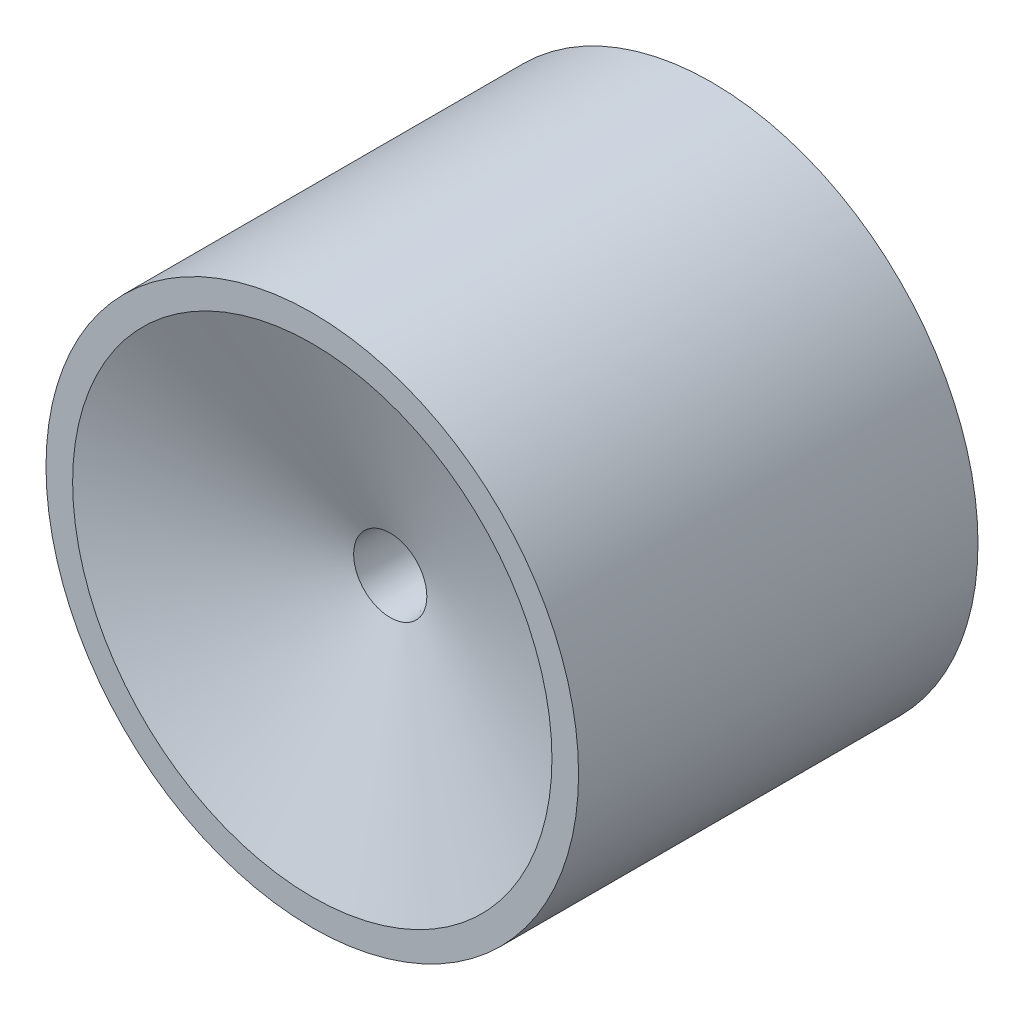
ISO-10303-21;
HEADER;
FILE_DESCRIPTION(('STEP AP214'),'2;1');
FILE_NAME('part.step','',(''),(''),'','','');
FILE_SCHEMA(('AUTOMOTIVE_DESIGN { 1 0 10303 214 1 1 1 1 }'));
ENDSEC;
DATA;
#1=APPLICATION_CONTEXT('core data for automotive mechanical design processes');
#2=APPLICATION_PROTOCOL_DEFINITION('international standard','automotive_design',2000,#1);
#3=PRODUCT_CONTEXT('',#1,'mechanical');
#4=PRODUCT('Part','Part','',(#3));
#5=PRODUCT_RELATED_PRODUCT_CATEGORY('part','',(#4));
#6=PRODUCT_DEFINITION_FORMATION('','',#4);
#7=PRODUCT_DEFINITION_CONTEXT('part definition',#1,'design');
#8=PRODUCT_DEFINITION('design','',#6,#7);
#9=PRODUCT_DEFINITION_SHAPE('','',#8);
#10=(LENGTH_UNIT() NAMED_UNIT(*) SI_UNIT(.MILLI.,.METRE.));
#11=(NAMED_UNIT(*) PLANE_ANGLE_UNIT() SI_UNIT($,.RADIAN.));
#12=(NAMED_UNIT(*) SI_UNIT($,.STERADIAN.) SOLID_ANGLE_UNIT());
#13=UNCERTAINTY_MEASURE_WITH_UNIT(LENGTH_MEASURE(1.E-05),#10,'distance_accuracy_value','');
#14=(GEOMETRIC_REPRESENTATION_CONTEXT(3) GLOBAL_UNCERTAINTY_ASSIGNED_CONTEXT((#13)) GLOBAL_UNIT_ASSIGNED_CONTEXT((#10,
#11,#12)) REPRESENTATION_CONTEXT('',''));
#15=CARTESIAN_POINT('',(0.,0.,0.));
#16=DIRECTION('',(0.,0.,1.));
#17=DIRECTION('',(1.,0.,0.));
#18=AXIS2_PLACEMENT_3D('',#15,#16,#17);
#19=CARTESIAN_POINT('',(0.,0.,0.));
#20=DIRECTION('',(0.,0.,1.));
#21=DIRECTION('',(1.,0.,0.));
#22=AXIS2_PLACEMENT_3D('',#19,#20,#21);
#23=PLANE('',#22);
#24=CARTESIAN_POINT('',(0.,0.,0.));
#25=DIRECTION('',(0.,0.,1.));
#26=DIRECTION('',(1.,0.,0.));
#27=AXIS2_PLACEMENT_3D('',#24,#25,#26);
#28=CIRCLE('',#27,3.4);
#29=CARTESIAN_POINT('',(3.4,0.,0.));
#30=VERTEX_POINT('',#29);
#31=EDGE_CURVE('E46',#30,#30,#28,.T.);
#32=ORIENTED_EDGE('',*,*,#31,.T.);
#33=EDGE_LOOP('',(#32));
#34=FACE_BOUND('',#33,.T.);
#35=CARTESIAN_POINT('',(0.,0.,0.));
#36=DIRECTION('',(0.,0.,-1.));
#37=DIRECTION('',(-1.,0.,0.));
#38=AXIS2_PLACEMENT_3D('',#35,#36,#37);
#39=CIRCLE('',#38,5.5);
#40=CARTESIAN_POINT('',(-5.5,0.,0.));
#41=VERTEX_POINT('',#40);
#42=EDGE_CURVE('E64',#41,#41,#39,.T.);
#43=ORIENTED_EDGE('',*,*,#42,.T.);
#44=EDGE_LOOP('',(#43));
#45=FACE_BOUND('',#44,.T.);
#46=ADVANCED_FACE('F31',(#34,#45),#23,.F.);
#47=CARTESIAN_POINT('',(0.,0.,0.));
#48=DIRECTION('',(0.,0.,-1.));
#49=DIRECTION('',(-1.,0.,0.));
#50=AXIS2_PLACEMENT_3D('',#47,#48,#49);
#51=CIRCLE('',#50,9.);
#52=CARTESIAN_POINT('',(-9.,0.,0.));
#53=VERTEX_POINT('',#52);
#54=EDGE_CURVE('E58',#53,#53,#51,.T.);
#55=ORIENTED_EDGE('',*,*,#54,.F.);
#56=EDGE_LOOP('',(#55));
#57=FACE_BOUND('',#56,.T.);
#58=CARTESIAN_POINT('',(0.,0.,0.));
#59=DIRECTION('',(0.,0.,1.));
#60=DIRECTION('',(1.,0.,0.));
#61=AXIS2_PLACEMENT_3D('',#58,#59,#60);
#62=CIRCLE('',#61,10.);
#63=CARTESIAN_POINT('',(10.,0.,0.));
#64=VERTEX_POINT('',#63);
#65=EDGE_CURVE('E39',#64,#64,#62,.T.);
#66=ORIENTED_EDGE('',*,*,#65,.F.);
#67=EDGE_LOOP('',(#66));
#68=FACE_BOUND('',#67,.T.);
#69=ADVANCED_FACE('F86',(#57,#68),#23,.F.);
#70=CARTESIAN_POINT('',(0.,0.,15.));
#71=DIRECTION('',(0.,0.,-1.));
#72=DIRECTION('',(-1.,0.,0.));
#73=AXIS2_PLACEMENT_3D('',#70,#71,#72);
#74=CYLINDRICAL_SURFACE('',#73,10.);
#75=CARTESIAN_POINT('',(0.,0.,15.));
#76=DIRECTION('',(0.,0.,1.));
#77=DIRECTION('',(1.,0.,0.));
#78=AXIS2_PLACEMENT_3D('',#75,#76,#77);
#79=CIRCLE('',#78,10.);
#80=CARTESIAN_POINT('',(10.,0.,15.));
#81=VERTEX_POINT('',#80);
#82=EDGE_CURVE('E10',#81,#81,#79,.T.);
#83=ORIENTED_EDGE('',*,*,#82,.F.);
#84=EDGE_LOOP('',(#83));
#85=FACE_BOUND('',#84,.T.);
#86=ORIENTED_EDGE('',*,*,#65,.T.);
#87=EDGE_LOOP('',(#86));
#88=FACE_BOUND('',#87,.T.);
#89=ADVANCED_FACE('F33',(#85,#88),#74,.T.);
#90=CARTESIAN_POINT('',(0.,0.,15.));
#91=DIRECTION('',(0.,0.,1.));
#92=DIRECTION('',(1.,0.,0.));
#93=AXIS2_PLACEMENT_3D('',#90,#91,#92);
#94=PLANE('',#93);
#95=CARTESIAN_POINT('',(0.,0.,15.));
#96=DIRECTION('',(0.,0.,1.));
#97=DIRECTION('',(1.,0.,0.));
#98=AXIS2_PLACEMENT_3D('',#95,#96,#97);
#99=CIRCLE('',#98,9.);
#100=CARTESIAN_POINT('',(9.,0.,15.));
#101=VERTEX_POINT('',#100);
#102=EDGE_CURVE('E54',#101,#101,#99,.T.);
#103=ORIENTED_EDGE('',*,*,#102,.F.);
#104=EDGE_LOOP('',(#103));
#105=FACE_BOUND('',#104,.T.);
#106=ORIENTED_EDGE('',*,*,#82,.T.);
#107=EDGE_LOOP('',(#106));
#108=FACE_BOUND('',#107,.T.);
#109=ADVANCED_FACE('F92',(#105,#108),#94,.T.);
#110=CARTESIAN_POINT('',(0.,0.,8.));
#111=DIRECTION('',(0.,0.,-1.));
#112=DIRECTION('',(-1.,0.,0.));
#113=AXIS2_PLACEMENT_3D('',#110,#111,#112);
#114=CYLINDRICAL_SURFACE('',#113,3.4);
#115=CARTESIAN_POINT('',(0.,0.,8.));
#116=DIRECTION('',(0.,0.,1.));
#117=DIRECTION('',(1.,0.,0.));
#118=AXIS2_PLACEMENT_3D('',#115,#116,#117);
#119=CIRCLE('',#118,3.4);
#120=CARTESIAN_POINT('',(3.4,0.,8.));
#121=VERTEX_POINT('',#120);
#122=EDGE_CURVE('E44',#121,#121,#119,.T.);
#123=ORIENTED_EDGE('',*,*,#122,.T.);
#124=EDGE_LOOP('',(#123));
#125=FACE_BOUND('',#124,.T.);
#126=ORIENTED_EDGE('',*,*,#31,.F.);
#127=EDGE_LOOP('',(#126));
#128=FACE_BOUND('',#127,.T.);
#129=ADVANCED_FACE('F97',(#125,#128),#114,.F.);
#130=CARTESIAN_POINT('',(0.,0.,8.));
#131=DIRECTION('',(0.,0.,1.));
#132=DIRECTION('',(1.,0.,0.));
#133=AXIS2_PLACEMENT_3D('',#130,#131,#132);
#134=PLANE('',#133);
#135=CARTESIAN_POINT('',(0.,0.,8.));
#136=DIRECTION('',(0.,0.,-1.));
#137=DIRECTION('',(-1.,0.,0.));
#138=AXIS2_PLACEMENT_3D('',#135,#136,#137);
#139=CIRCLE('',#138,1.2);
#140=CARTESIAN_POINT('',(-1.2,0.,8.));
#141=VERTEX_POINT('',#140);
#142=EDGE_CURVE('E49',#141,#141,#139,.T.);
#143=ORIENTED_EDGE('',*,*,#142,.F.);
#144=EDGE_LOOP('',(#143));
#145=FACE_BOUND('',#144,.T.);
#146=ORIENTED_EDGE('',*,*,#122,.F.);
#147=EDGE_LOOP('',(#146));
#148=FACE_BOUND('',#147,.T.);
#149=ADVANCED_FACE('F108',(#145,#148),#134,.F.);
#150=CARTESIAN_POINT('',(0.,0.,8.));
#151=DIRECTION('',(0.,0.,1.));
#152=DIRECTION('',(-1.,0.,0.));
#153=AXIS2_PLACEMENT_3D('',#150,#151,#152);
#154=CONICAL_SURFACE('',#153,1.2,0.0427605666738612);
#155=CARTESIAN_POINT('',(0.,0.,12.0727524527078));
#156=DIRECTION('',(0.,0.,1.));
#157=DIRECTION('',(1.,0.,0.));
#158=AXIS2_PLACEMENT_3D('',#155,#156,#157);
#159=CIRCLE('',#158,1.3742594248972);
#160=CARTESIAN_POINT('',(1.3742594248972,0.,12.0727524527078));
#161=VERTEX_POINT('',#160);
#162=EDGE_CURVE('E35',#161,#161,#159,.T.);
#163=ORIENTED_EDGE('',*,*,#162,.T.);
#164=EDGE_LOOP('',(#163));
#165=FACE_BOUND('',#164,.T.);
#166=ORIENTED_EDGE('',*,*,#142,.T.);
#167=EDGE_LOOP('',(#166));
#168=FACE_BOUND('',#167,.T.);
#169=ADVANCED_FACE('F112',(#165,#168),#154,.F.);
#170=CARTESIAN_POINT('',(0.,0.,15.));
#171=DIRECTION('',(0.,0.,1.));
#172=DIRECTION('',(1.,0.,0.));
#173=AXIS2_PLACEMENT_3D('',#170,#171,#172);
#174=CONICAL_SURFACE('',#173,9.,1.20427718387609);
#175=CARTESIAN_POINT('',(9.,0.,15.));
#176=CARTESIAN_POINT('',(8.92056520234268,0.,14.969507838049));
#177=CARTESIAN_POINT('',(8.84113040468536,0.,14.9390156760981));
#178=CARTESIAN_POINT('',(8.68226080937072,0.,14.8780313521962));
#179=CARTESIAN_POINT('',(8.60282601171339,0.,14.8475391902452));
#180=CARTESIAN_POINT('',(8.44395641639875,0.,14.7865548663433));
#181=CARTESIAN_POINT('',(8.36452161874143,0.,14.7560627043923));
#182=CARTESIAN_POINT('',(8.20565202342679,0.,14.6950783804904));
#183=CARTESIAN_POINT('',(8.12621722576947,0.,14.6645862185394));
#184=CARTESIAN_POINT('',(7.96734763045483,0.,14.6036018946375));
#185=CARTESIAN_POINT('',(7.8879128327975,0.,14.5731097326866));
#186=CARTESIAN_POINT('',(7.72904323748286,0.,14.5121254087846));
#187=CARTESIAN_POINT('',(7.64960843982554,0.,14.4816332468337));
#188=CARTESIAN_POINT('',(7.4907388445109,0.,14.4206489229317));
#189=CARTESIAN_POINT('',(7.41130404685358,0.,14.3901567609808));
#190=CARTESIAN_POINT('',(7.25243445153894,0.,14.3291724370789));
#191=CARTESIAN_POINT('',(7.17299965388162,0.,14.2986802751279));
#192=CARTESIAN_POINT('',(7.01413005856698,0.,14.237695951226));
#193=CARTESIAN_POINT('',(6.93469526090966,0.,14.207203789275));
#194=CARTESIAN_POINT('',(6.77582566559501,0.,14.1462194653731));
#195=CARTESIAN_POINT('',(6.6963908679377,0.,14.1157273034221));
#196=CARTESIAN_POINT('',(6.53752127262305,0.,14.0547429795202));
#197=CARTESIAN_POINT('',(6.45808647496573,0.,14.0242508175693));
#198=CARTESIAN_POINT('',(6.29921687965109,0.,13.9632664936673));
#199=CARTESIAN_POINT('',(6.21978208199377,0.,13.9327743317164));
#200=CARTESIAN_POINT('',(6.06091248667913,0.,13.8717900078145));
#201=CARTESIAN_POINT('',(5.98147768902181,0.,13.8412978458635));
#202=CARTESIAN_POINT('',(5.82260809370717,0.,13.7803135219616));
#203=CARTESIAN_POINT('',(5.74317329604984,0.,13.7498213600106));
#204=CARTESIAN_POINT('',(5.5843037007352,0.,13.6888370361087));
#205=CARTESIAN_POINT('',(5.50486890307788,0.,13.6583448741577));
#206=CARTESIAN_POINT('',(5.34599930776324,0.,13.5973605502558));
#207=CARTESIAN_POINT('',(5.26656451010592,0.,13.5668683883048));
#208=CARTESIAN_POINT('',(5.10769491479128,0.,13.5058840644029));
#209=CARTESIAN_POINT('',(5.02826011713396,0.,13.475391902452));
#210=CARTESIAN_POINT('',(4.86939052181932,0.,13.41440757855));
#211=CARTESIAN_POINT('',(4.789955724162,0.,13.3839154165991));
#212=CARTESIAN_POINT('',(4.63108612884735,0.,13.3229310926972));
#213=CARTESIAN_POINT('',(4.55165133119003,0.,13.2924389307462));
#214=CARTESIAN_POINT('',(4.39278173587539,0.,13.2314546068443));
#215=CARTESIAN_POINT('',(4.31334693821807,0.,13.2009624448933));
#216=CARTESIAN_POINT('',(4.15447734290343,0.,13.1399781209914));
#217=CARTESIAN_POINT('',(4.07504254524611,0.,13.1094859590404));
#218=CARTESIAN_POINT('',(3.91617294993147,0.,13.0485016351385));
#219=CARTESIAN_POINT('',(3.83673815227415,0.,13.0180094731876));
#220=CARTESIAN_POINT('',(3.6778685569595,0.,12.9570251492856));
#221=CARTESIAN_POINT('',(3.59843375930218,0.,12.9265329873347));
#222=CARTESIAN_POINT('',(3.43956416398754,0.,12.8655486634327));
#223=CARTESIAN_POINT('',(3.36012936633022,0.,12.8350565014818));
#224=CARTESIAN_POINT('',(3.20125977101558,0.,12.7740721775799));
#225=CARTESIAN_POINT('',(3.12182497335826,0.,12.7435800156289));
#226=CARTESIAN_POINT('',(2.96295537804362,0.,12.682595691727));
#227=CARTESIAN_POINT('',(2.8835205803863,0.,12.652103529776));
#228=CARTESIAN_POINT('',(2.72465098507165,0.,12.5911192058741));
#229=CARTESIAN_POINT('',(2.64521618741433,0.,12.5606270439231));
#230=CARTESIAN_POINT('',(2.48634659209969,0.,12.4996427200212));
#231=CARTESIAN_POINT('',(2.40691179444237,0.,12.4691505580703));
#232=CARTESIAN_POINT('',(2.24804219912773,0.,12.4081662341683));
#233=CARTESIAN_POINT('',(2.16860740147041,0.,12.3776740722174));
#234=CARTESIAN_POINT('',(2.00973780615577,0.,12.3166897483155));
#235=CARTESIAN_POINT('',(1.93030300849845,0.,12.2861975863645));
#236=CARTESIAN_POINT('',(1.7714334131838,0.,12.2252132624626));
#237=CARTESIAN_POINT('',(1.69199861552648,0.,12.1947211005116));
#238=CARTESIAN_POINT('',(1.53312902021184,0.,12.1337367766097));
#239=CARTESIAN_POINT('',(1.45369422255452,0.,12.1032446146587));
#240=CARTESIAN_POINT('',(1.3742594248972,0.,12.0727524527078));
#241=B_SPLINE_CURVE_WITH_KNOTS('',3,(#175,#176,#177,#178,#179,#180,#181,#182,#183,#184,#185,
#186,#187,#188,#189,#190,#191,#192,#193,#194,#195,#196,#197,#198,#199,#200,#201,#202,#203,#204,
#205,#206,#207,#208,#209,#210,#211,#212,#213,#214,#215,#216,#217,#218,#219,#220,#221,#222,#223,
#224,#225,#226,#227,#228,#229,#230,#231,#232,#233,#234,#235,#236,#237,#238,#239,#240),
.UNSPECIFIED.,.F.,.F.,(4,2,2,2,2,2,2,2,2,2,2,2,2,2,2,2,2,2,2,2,2,2,2,2,2,2,2,2,2,2,2,2,4),(0.,
0.255258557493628,0.510517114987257,0.765775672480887,1.02103422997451,1.27629278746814,
1.53155134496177,1.7868099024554,2.04206845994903,2.29732701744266,2.55258557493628,
2.80784413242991,3.06310268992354,3.31836124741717,3.5736198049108,3.82887836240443,
4.08413691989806,4.33939547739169,4.59465403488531,4.84991259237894,5.10517114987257,
5.3604297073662,5.61568826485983,5.87094682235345,6.12620537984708,6.38146393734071,
6.63672249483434,6.89198105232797,7.1472396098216,7.40249816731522,7.65775672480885,
7.91301528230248,8.16827383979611),.UNSPECIFIED.);
#242=EDGE_CURVE('BSEAM82',#101,#161,#241,.T.);
#243=ORIENTED_EDGE('',*,*,#102,.T.);
#244=ORIENTED_EDGE('',*,*,#162,.F.);
#245=ORIENTED_EDGE('',*,*,#242,.T.);
#246=ORIENTED_EDGE('',*,*,#242,.F.);
#247=EDGE_LOOP('',(#243,#245,#244,#246));
#248=FACE_BOUND('',#247,.T.);
#249=ADVANCED_FACE('F82',(#248),#174,.F.);
#250=CARTESIAN_POINT('',(0.,0.,13.));
#251=DIRECTION('',(0.,0.,-1.));
#252=DIRECTION('',(-1.,0.,0.));
#253=AXIS2_PLACEMENT_3D('',#250,#251,#252);
#254=CYLINDRICAL_SURFACE('',#253,9.);
#255=CARTESIAN_POINT('',(0.,0.,13.));
#256=DIRECTION('',(0.,0.,-1.));
#257=DIRECTION('',(-1.,0.,0.));
#258=AXIS2_PLACEMENT_3D('',#255,#256,#257);
#259=CIRCLE('',#258,9.);
#260=CARTESIAN_POINT('',(-9.,0.,13.));
#261=VERTEX_POINT('',#260);
#262=EDGE_CURVE('E57',#261,#261,#259,.T.);
#263=CARTESIAN_POINT('',(-9.,0.,13.));
#264=CARTESIAN_POINT('',(-9.,0.,12.8645833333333));
#265=CARTESIAN_POINT('',(-9.,0.,12.7291666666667));
#266=CARTESIAN_POINT('',(-9.,0.,12.4583333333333));
#267=CARTESIAN_POINT('',(-9.,0.,12.3229166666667));
#268=CARTESIAN_POINT('',(-9.,0.,12.0520833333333));
#269=CARTESIAN_POINT('',(-9.,0.,11.9166666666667));
#270=CARTESIAN_POINT('',(-9.,0.,11.6458333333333));
#271=CARTESIAN_POINT('',(-9.,0.,11.5104166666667));
#272=CARTESIAN_POINT('',(-9.,0.,11.2395833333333));
#273=CARTESIAN_POINT('',(-9.,0.,11.1041666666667));
#274=CARTESIAN_POINT('',(-9.,0.,10.8333333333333));
#275=CARTESIAN_POINT('',(-9.,0.,10.6979166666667));
#276=CARTESIAN_POINT('',(-9.,0.,10.4270833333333));
#277=CARTESIAN_POINT('',(-9.,0.,10.2916666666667));
#278=CARTESIAN_POINT('',(-9.,0.,10.0208333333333));
#279=CARTESIAN_POINT('',(-9.,0.,9.88541666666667));
#280=CARTESIAN_POINT('',(-9.,0.,9.61458333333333));
#281=CARTESIAN_POINT('',(-9.,0.,9.47916666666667));
#282=CARTESIAN_POINT('',(-9.,0.,9.20833333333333));
#283=CARTESIAN_POINT('',(-9.,0.,9.07291666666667));
#284=CARTESIAN_POINT('',(-9.,0.,8.80208333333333));
#285=CARTESIAN_POINT('',(-9.,0.,8.66666666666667));
#286=CARTESIAN_POINT('',(-9.,0.,8.39583333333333));
#287=CARTESIAN_POINT('',(-9.,0.,8.26041666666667));
#288=CARTESIAN_POINT('',(-9.,0.,7.98958333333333));
#289=CARTESIAN_POINT('',(-9.,0.,7.85416666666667));
#290=CARTESIAN_POINT('',(-9.,0.,7.58333333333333));
#291=CARTESIAN_POINT('',(-9.,0.,7.44791666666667));
#292=CARTESIAN_POINT('',(-9.,0.,7.17708333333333));
#293=CARTESIAN_POINT('',(-9.,0.,7.04166666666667));
#294=CARTESIAN_POINT('',(-9.,0.,6.77083333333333));
#295=CARTESIAN_POINT('',(-9.,0.,6.63541666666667));
#296=CARTESIAN_POINT('',(-9.,0.,6.36458333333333));
#297=CARTESIAN_POINT('',(-9.,0.,6.22916666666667));
#298=CARTESIAN_POINT('',(-9.,0.,5.95833333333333));
#299=CARTESIAN_POINT('',(-9.,0.,5.82291666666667));
#300=CARTESIAN_POINT('',(-9.,0.,5.55208333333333));
#301=CARTESIAN_POINT('',(-9.,0.,5.41666666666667));
#302=CARTESIAN_POINT('',(-9.,0.,5.14583333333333));
#303=CARTESIAN_POINT('',(-9.,0.,5.01041666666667));
#304=CARTESIAN_POINT('',(-9.,0.,4.73958333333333));
#305=CARTESIAN_POINT('',(-9.,0.,4.60416666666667));
#306=CARTESIAN_POINT('',(-9.,0.,4.33333333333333));
#307=CARTESIAN_POINT('',(-9.,0.,4.19791666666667));
#308=CARTESIAN_POINT('',(-9.,0.,3.92708333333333));
#309=CARTESIAN_POINT('',(-9.,0.,3.79166666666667));
#310=CARTESIAN_POINT('',(-9.,0.,3.52083333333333));
#311=CARTESIAN_POINT('',(-9.,0.,3.38541666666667));
#312=CARTESIAN_POINT('',(-9.,0.,3.11458333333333));
#313=CARTESIAN_POINT('',(-9.,0.,2.97916666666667));
#314=CARTESIAN_POINT('',(-9.,0.,2.70833333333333));
#315=CARTESIAN_POINT('',(-9.,0.,2.57291666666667));
#316=CARTESIAN_POINT('',(-9.,0.,2.30208333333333));
#317=CARTESIAN_POINT('',(-9.,0.,2.16666666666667));
#318=CARTESIAN_POINT('',(-9.,0.,1.89583333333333));
#319=CARTESIAN_POINT('',(-9.,0.,1.76041666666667));
#320=CARTESIAN_POINT('',(-9.,0.,1.48958333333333));
#321=CARTESIAN_POINT('',(-9.,0.,1.35416666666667));
#322=CARTESIAN_POINT('',(-9.,0.,1.08333333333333));
#323=CARTESIAN_POINT('',(-9.,0.,0.947916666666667));
#324=CARTESIAN_POINT('',(-9.,0.,0.677083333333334));
#325=CARTESIAN_POINT('',(-9.,0.,0.541666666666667));
#326=CARTESIAN_POINT('',(-9.,0.,0.270833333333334));
#327=CARTESIAN_POINT('',(-9.,0.,0.135416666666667));
#328=CARTESIAN_POINT('',(-9.,0.,0.));
#329=B_SPLINE_CURVE_WITH_KNOTS('',3,(#263,#264,#265,#266,#267,#268,#269,#270,#271,#272,#273,
#274,#275,#276,#277,#278,#279,#280,#281,#282,#283,#284,#285,#286,#287,#288,#289,#290,#291,#292,
#293,#294,#295,#296,#297,#298,#299,#300,#301,#302,#303,#304,#305,#306,#307,#308,#309,#310,#311,
#312,#313,#314,#315,#316,#317,#318,#319,#320,#321,#322,#323,#324,#325,#326,#327,#328),
.UNSPECIFIED.,.F.,.F.,(4,2,2,2,2,2,2,2,2,2,2,2,2,2,2,2,2,2,2,2,2,2,2,2,2,2,2,2,2,2,2,2,4),(0.,
0.406249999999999,0.812499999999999,1.21875,1.625,2.03125,2.4375,2.84375,3.25,3.65625,4.0625,
4.46875,4.875,5.28125,5.6875,6.09375,6.5,6.90625,7.3125,7.71875,8.125,8.53125,8.9375,9.34375,
9.75,10.15625,10.5625,10.96875,11.375,11.78125,12.1875,12.59375,13.),.UNSPECIFIED.);
#330=EDGE_CURVE('BSEAM76',#261,#53,#329,.T.);
#331=ORIENTED_EDGE('',*,*,#262,.F.);
#332=ORIENTED_EDGE('',*,*,#54,.T.);
#333=ORIENTED_EDGE('',*,*,#330,.T.);
#334=ORIENTED_EDGE('',*,*,#330,.F.);
#335=EDGE_LOOP('',(#331,#333,#332,#334));
#336=FACE_BOUND('',#335,.T.);
#337=ADVANCED_FACE('F76',(#336),#254,.F.);
#338=CARTESIAN_POINT('',(0.,0.,13.));
#339=DIRECTION('',(0.,0.,-1.));
#340=DIRECTION('',(-1.,0.,0.));
#341=AXIS2_PLACEMENT_3D('',#338,#339,#340);
#342=PLANE('',#341);
#343=CARTESIAN_POINT('',(0.,0.,13.));
#344=DIRECTION('',(0.,0.,-1.));
#345=DIRECTION('',(-1.,0.,0.));
#346=AXIS2_PLACEMENT_3D('',#343,#344,#345);
#347=CIRCLE('',#346,5.5);
#348=CARTESIAN_POINT('',(-5.5,0.,13.));
#349=VERTEX_POINT('',#348);
#350=EDGE_CURVE('E61',#349,#349,#347,.T.);
#351=ORIENTED_EDGE('',*,*,#350,.F.);
#352=EDGE_LOOP('',(#351));
#353=FACE_BOUND('',#352,.T.);
#354=ORIENTED_EDGE('',*,*,#262,.T.);
#355=EDGE_LOOP('',(#354));
#356=FACE_BOUND('',#355,.T.);
#357=ADVANCED_FACE('F73',(#353,#356),#342,.T.);
#358=CARTESIAN_POINT('',(0.,0.,13.));
#359=DIRECTION('',(0.,0.,-1.));
#360=DIRECTION('',(-1.,0.,0.));
#361=AXIS2_PLACEMENT_3D('',#358,#359,#360);
#362=CYLINDRICAL_SURFACE('',#361,5.5);
#363=CARTESIAN_POINT('',(-5.5,0.,13.));
#364=CARTESIAN_POINT('',(-5.5,0.,12.8645833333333));
#365=CARTESIAN_POINT('',(-5.5,0.,12.7291666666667));
#366=CARTESIAN_POINT('',(-5.5,0.,12.4583333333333));
#367=CARTESIAN_POINT('',(-5.5,0.,12.3229166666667));
#368=CARTESIAN_POINT('',(-5.5,0.,12.0520833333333));
#369=CARTESIAN_POINT('',(-5.5,0.,11.9166666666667));
#370=CARTESIAN_POINT('',(-5.5,0.,11.6458333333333));
#371=CARTESIAN_POINT('',(-5.5,0.,11.5104166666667));
#372=CARTESIAN_POINT('',(-5.5,0.,11.2395833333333));
#373=CARTESIAN_POINT('',(-5.5,0.,11.1041666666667));
#374=CARTESIAN_POINT('',(-5.5,0.,10.8333333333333));
#375=CARTESIAN_POINT('',(-5.5,0.,10.6979166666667));
#376=CARTESIAN_POINT('',(-5.5,0.,10.4270833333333));
#377=CARTESIAN_POINT('',(-5.5,0.,10.2916666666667));
#378=CARTESIAN_POINT('',(-5.5,0.,10.0208333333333));
#379=CARTESIAN_POINT('',(-5.5,0.,9.88541666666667));
#380=CARTESIAN_POINT('',(-5.5,0.,9.61458333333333));
#381=CARTESIAN_POINT('',(-5.5,0.,9.47916666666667));
#382=CARTESIAN_POINT('',(-5.5,0.,9.20833333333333));
#383=CARTESIAN_POINT('',(-5.5,0.,9.07291666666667));
#384=CARTESIAN_POINT('',(-5.5,0.,8.80208333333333));
#385=CARTESIAN_POINT('',(-5.5,0.,8.66666666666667));
#386=CARTESIAN_POINT('',(-5.5,0.,8.39583333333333));
#387=CARTESIAN_POINT('',(-5.5,0.,8.26041666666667));
#388=CARTESIAN_POINT('',(-5.5,0.,7.98958333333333));
#389=CARTESIAN_POINT('',(-5.5,0.,7.85416666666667));
#390=CARTESIAN_POINT('',(-5.5,0.,7.58333333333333));
#391=CARTESIAN_POINT('',(-5.5,0.,7.44791666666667));
#392=CARTESIAN_POINT('',(-5.5,0.,7.17708333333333));
#393=CARTESIAN_POINT('',(-5.5,0.,7.04166666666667));
#394=CARTESIAN_POINT('',(-5.5,0.,6.77083333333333));
#395=CARTESIAN_POINT('',(-5.5,0.,6.63541666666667));
#396=CARTESIAN_POINT('',(-5.5,0.,6.36458333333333));
#397=CARTESIAN_POINT('',(-5.5,0.,6.22916666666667));
#398=CARTESIAN_POINT('',(-5.5,0.,5.95833333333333));
#399=CARTESIAN_POINT('',(-5.5,0.,5.82291666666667));
#400=CARTESIAN_POINT('',(-5.5,0.,5.55208333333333));
#401=CARTESIAN_POINT('',(-5.5,0.,5.41666666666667));
#402=CARTESIAN_POINT('',(-5.5,0.,5.14583333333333));
#403=CARTESIAN_POINT('',(-5.5,0.,5.01041666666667));
#404=CARTESIAN_POINT('',(-5.5,0.,4.73958333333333));
#405=CARTESIAN_POINT('',(-5.5,0.,4.60416666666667));
#406=CARTESIAN_POINT('',(-5.5,0.,4.33333333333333));
#407=CARTESIAN_POINT('',(-5.5,0.,4.19791666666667));
#408=CARTESIAN_POINT('',(-5.5,0.,3.92708333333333));
#409=CARTESIAN_POINT('',(-5.5,0.,3.79166666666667));
#410=CARTESIAN_POINT('',(-5.5,0.,3.52083333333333));
#411=CARTESIAN_POINT('',(-5.5,0.,3.38541666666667));
#412=CARTESIAN_POINT('',(-5.5,0.,3.11458333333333));
#413=CARTESIAN_POINT('',(-5.5,0.,2.97916666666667));
#414=CARTESIAN_POINT('',(-5.5,0.,2.70833333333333));
#415=CARTESIAN_POINT('',(-5.5,0.,2.57291666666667));
#416=CARTESIAN_POINT('',(-5.5,0.,2.30208333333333));
#417=CARTESIAN_POINT('',(-5.5,0.,2.16666666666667));
#418=CARTESIAN_POINT('',(-5.5,0.,1.89583333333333));
#419=CARTESIAN_POINT('',(-5.5,0.,1.76041666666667));
#420=CARTESIAN_POINT('',(-5.5,0.,1.48958333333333));
#421=CARTESIAN_POINT('',(-5.5,0.,1.35416666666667));
#422=CARTESIAN_POINT('',(-5.5,0.,1.08333333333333));
#423=CARTESIAN_POINT('',(-5.5,0.,0.947916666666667));
#424=CARTESIAN_POINT('',(-5.5,0.,0.677083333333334));
#425=CARTESIAN_POINT('',(-5.5,0.,0.541666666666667));
#426=CARTESIAN_POINT('',(-5.5,0.,0.270833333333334));
#427=CARTESIAN_POINT('',(-5.5,0.,0.135416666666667));
#428=CARTESIAN_POINT('',(-5.5,0.,0.));
#429=B_SPLINE_CURVE_WITH_KNOTS('',3,(#363,#364,#365,#366,#367,#368,#369,#370,#371,#372,#373,
#374,#375,#376,#377,#378,#379,#380,#381,#382,#383,#384,#385,#386,#387,#388,#389,#390,#391,#392,
#393,#394,#395,#396,#397,#398,#399,#400,#401,#402,#403,#404,#405,#406,#407,#408,#409,#410,#411,
#412,#413,#414,#415,#416,#417,#418,#419,#420,#421,#422,#423,#424,#425,#426,#427,#428),
.UNSPECIFIED.,.F.,.F.,(4,2,2,2,2,2,2,2,2,2,2,2,2,2,2,2,2,2,2,2,2,2,2,2,2,2,2,2,2,2,2,2,4),(0.,
0.40625,0.812500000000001,1.21875,1.625,2.03125,2.4375,2.84375,3.25,3.65625,4.0625,4.46875,
4.875,5.28125,5.6875,6.09375,6.5,6.90625,7.3125,7.71875,8.125,8.53125,8.9375,9.34375,9.75,
10.15625,10.5625,10.96875,11.375,11.78125,12.1875,12.59375,13.),.UNSPECIFIED.);
#430=EDGE_CURVE('BSEAM70',#349,#41,#429,.T.);
#431=ORIENTED_EDGE('',*,*,#350,.T.);
#432=ORIENTED_EDGE('',*,*,#42,.F.);
#433=ORIENTED_EDGE('',*,*,#430,.T.);
#434=ORIENTED_EDGE('',*,*,#430,.F.);
#435=EDGE_LOOP('',(#431,#433,#432,#434));
#436=FACE_BOUND('',#435,.T.);
#437=ADVANCED_FACE('F70',(#436),#362,.T.);
#438=CLOSED_SHELL('',(#46,#69,#89,#109,#129,#149,#169,#249,#337,#357,#437));
#439=MANIFOLD_SOLID_BREP('B2',#438);
#440=ADVANCED_BREP_SHAPE_REPRESENTATION('',(#18,#439),#14);
#441=SHAPE_DEFINITION_REPRESENTATION(#9,#440);
ENDSEC;
END-ISO-10303-21;
